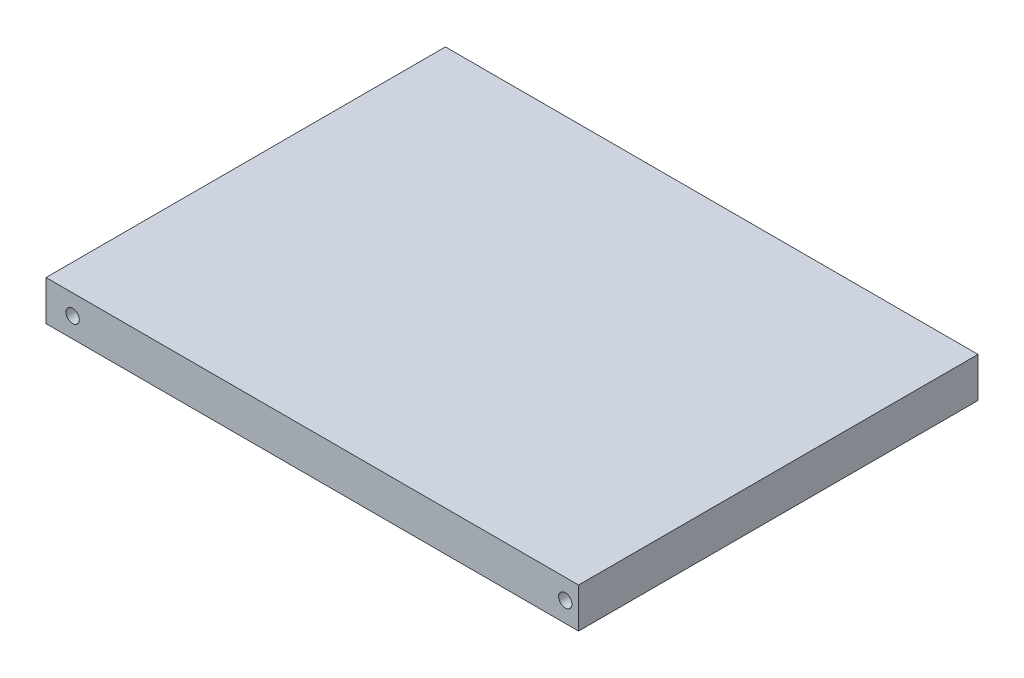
from build123d import *

# Parameters (mm, degrees)
ESQUISSE1_W      = 400
ESQUISSE1_H      = 30
ESQUISSE1_R      = 5
EXTRUSION1_DEPTH = 150


with BuildPart() as part:
    # Esquisse1 → Extrusion1 (new, symmetric)
    with BuildSketch(Plane.XY):
        with Locations((200, 15)):
            Rectangle(ESQUISSE1_W, ESQUISSE1_H)
        with Locations((20, 15)):
            Circle(ESQUISSE1_R, mode=Mode.SUBTRACT)
        with Locations((390, 15)):
            Circle(ESQUISSE1_R, mode=Mode.SUBTRACT)
    extrude(amount=EXTRUSION1_DEPTH, both=True)


solid = part.part
